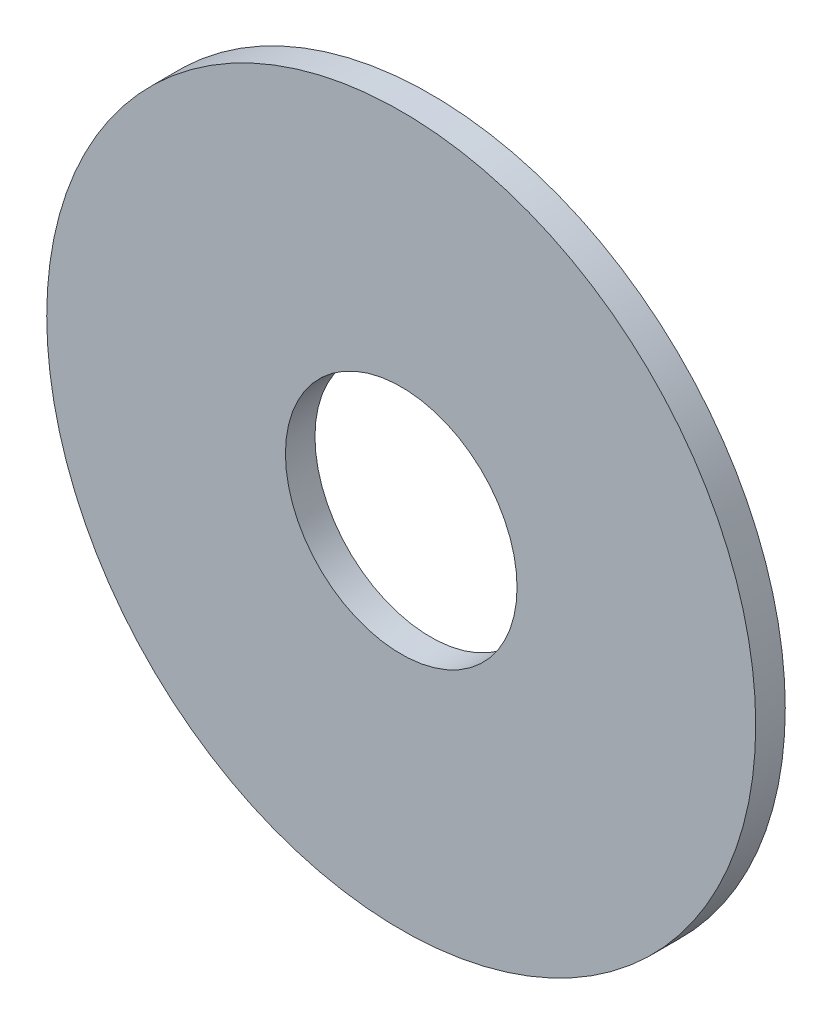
from build123d import *

# Parameters (mm, degrees)
ESQUISSE1_R      = 6
ESQUISSE1_R_2    = 1.96
EXTRUSION1_DEPTH = 0.5


with BuildPart() as part:
    # Esquisse1 → Extrusion1 (new body)
    with BuildSketch(Plane.XY):
        Circle(ESQUISSE1_R)
        Circle(ESQUISSE1_R_2, mode=Mode.SUBTRACT)
    extrude(amount=EXTRUSION1_DEPTH)


solid = part.part
